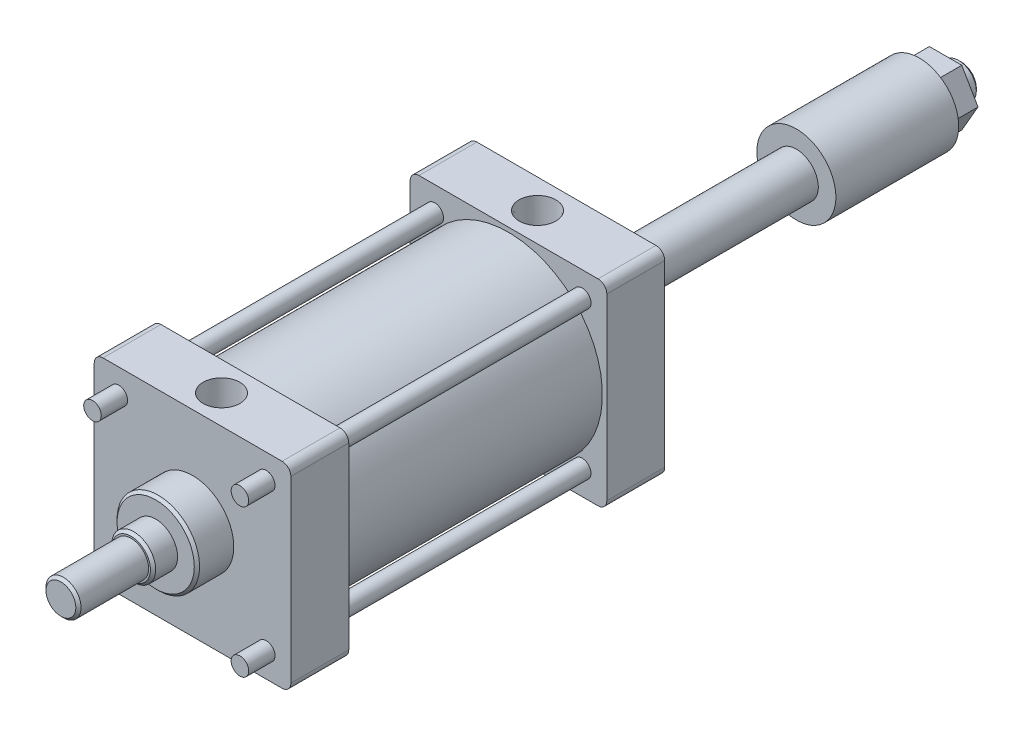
from build123d import *

# Parameters (mm, degrees)
SKETCH_1_R              = 5
EXTRUDE_1_DEPTH         = 33
SKETCH_2_R              = 23.5
EXTRUDE_2_DEPTH         = 21
SKETCH_3_R              = 12.5
EXTRUDE_3_DEPTH         = 14
SKETCH_4_R              = 10
EXTRUDE_4_DEPTH         = 40
CHAMFER_1_SIZE          = 1.5
SKETCH_5_R              = 53.5
EXTRUDE_5_DEPTH         = 147
EXTRUDE_START           = 33
SKETCH_7_R              = 5
EXTRUDE_6_DEPTH         = 33
EXTRUDE_START_2         = 21
SKETCH_8_R              = 23.5
EXTRUDE_7_DEPTH         = 21
CHAMFER_2_SIZE          = 1.5
SKETCH_9_R              = 22.5
EXTRUDE_8_DEPTH         = 10
EXTRUDE_START_3         = 100
SKETCH_10_R             = 12.5
EXTRUDE_9_DEPTH         = 100
SKETCH_11_R             = 22.5
EXTRUDE_10_DEPTH        = 70
EXTRUDE_11_DEPTH        = 15
EXTRUDE_START_4         = 9
SKETCH_13_R             = 10
EXTRUDE_12_DEPTH        = 9
CHAMFER_3_SIZE          = 1.5
EXTRUDE_13_DEPTH        = 15
EXTRUDE_13_DEPTH_BACK   = 213
SKETCH_14_R             = 5
EXTRUDE_13_2_DEPTH      = 15
EXTRUDE_13_2_DEPTH_BACK = 213
EXTRUDE_13_3_DEPTH      = 15
EXTRUDE_13_3_DEPTH_BACK = 213
EXTRUDE_13_4_DEPTH      = 15
EXTRUDE_13_4_DEPTH_BACK = 213
F_1_2_RC_1_AT_2_COUNT   = 2
F_1_2_RC_1_AT_2_PITCH   = 180


with BuildPart() as part:
    # Sketch 1 → Extrude 1 (new body)
    with BuildSketch(Plane.XY):
        with BuildLine():
            Line((51, 56), (-51, 56))
            ThreePointArc((-51, 56), (-54.535533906, 54.535533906), (-56, 51))
            Line((-56, 51), (-56, -51))
            ThreePointArc((-56, -51), (-54.535533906, -54.535533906), (-51, -56))
            Line((-51, -56), (51, -56))
            ThreePointArc((51, -56), (54.535533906, -54.535533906), (56, -51))
            Line((56, -51), (56, 51))
            ThreePointArc((56, 51), (54.535533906, 54.535533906), (51, 56))
        make_face()
        with Locations((42, -42)):
            Circle(SKETCH_1_R, mode=Mode.SUBTRACT)
        with Locations((-42, -42)):
            Circle(SKETCH_1_R, mode=Mode.SUBTRACT)
        with Locations((-42, 42)):
            Circle(SKETCH_1_R, mode=Mode.SUBTRACT)
        with Locations((42, 42)):
            Circle(SKETCH_1_R, mode=Mode.SUBTRACT)
    extrude(amount=EXTRUDE_1_DEPTH)

    # Sketch 2 → Extrude 2 (add)
    with BuildSketch(Plane.XY.offset(33)):
        with Locations(Location((0, 0, 0), (0, 0, 180))):
            Circle(SKETCH_2_R)
    extrude(amount=EXTRUDE_2_DEPTH)

    # Sketch 3 → Extrude 3 (add)
    with BuildSketch(Plane.XY.offset(54)):
        Circle(SKETCH_3_R)
    extrude(amount=EXTRUDE_3_DEPTH)

    # Sketch 4 → Extrude 4 (add)
    with BuildSketch(Plane.XY.offset(68)):
        Circle(SKETCH_4_R)
    extrude(amount=EXTRUDE_4_DEPTH)

    # Chamfer 1
    chamfer_1_edges = [part.edges().sort_by_distance(p)[0] for p in [
        (23.5, 0, 54),
        (-12.5, 0, 68),
        (-10, 0, 108),
    ]]
    chamfer(chamfer_1_edges, length=CHAMFER_1_SIZE)

    # Sketch 5 → Extrude 5 (add)
    with BuildSketch(Plane(origin=(0, 0, 0), x_dir=(-1, 0, 0), z_dir=(0, 0, -1))):
        Circle(SKETCH_5_R)
    extrude(amount=EXTRUDE_5_DEPTH)

    # Sketch 7 → Extrude 6 (add)
    with BuildSketch(Plane(origin=(0, 0, -147), x_dir=(-1, 0, 0), z_dir=(0, 0, -1)).offset(EXTRUDE_START)):
        with BuildLine():
            Line((-56, 51), (-56, -51))
            ThreePointArc((-56, -51), (-54.535533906, -54.535533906), (-51, -56))
            Line((-51, -56), (51, -56))
            ThreePointArc((51, -56), (54.535533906, -54.535533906), (56, -51))
            Line((56, -51), (56, 51))
            ThreePointArc((56, 51), (54.535533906, 54.535533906), (51, 56))
            Line((51, 56), (-51, 56))
            ThreePointArc((-51, 56), (-54.535533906, 54.535533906), (-56, 51))
        make_face()
        with Locations(Location((42, -42, 0), (0, 0, 180))):
            Circle(SKETCH_7_R, mode=Mode.SUBTRACT)
        with Locations(Location((-42, -42, 0), (0, 0, 180))):
            Circle(SKETCH_7_R, mode=Mode.SUBTRACT)
        with Locations(Location((42, 42, 0), (0, 0, 180))):
            Circle(SKETCH_7_R, mode=Mode.SUBTRACT)
        with Locations(Location((-42, 42, 0), (0, 0, 180))):
            Circle(SKETCH_7_R, mode=Mode.SUBTRACT)
    extrude(amount=-EXTRUDE_6_DEPTH)

    # Sketch 8 → Extrude 7 (add)
    with BuildSketch(Plane(origin=(0, 0, -180), x_dir=(-1, 0, 0), z_dir=(0, 0, -1)).offset(EXTRUDE_START_2)):
        Circle(SKETCH_8_R)
    extrude(amount=-EXTRUDE_7_DEPTH)

    # Chamfer 2
    chamfer_2_edges = [part.edges().sort_by_distance(p)[0] for p in [
        (23.5, 0, -201),
    ]]
    chamfer(chamfer_2_edges, length=CHAMFER_2_SIZE)

    # Sketch 9 → Extrude 8 (add)
    with BuildSketch(Plane(origin=(0, 0, -201), x_dir=(-1, 0, 0), z_dir=(0, 0, -1))):
        Circle(SKETCH_9_R)
    extrude(amount=EXTRUDE_8_DEPTH)

    # Sketch 10 → Extrude 9 (add)
    with BuildSketch(Plane(origin=(0, 0, -211), x_dir=(-1, 0, 0), z_dir=(0, 0, -1)).offset(EXTRUDE_START_3)):
        with Locations(Location((0, 0, 0), (0, 0, 180))):
            Circle(SKETCH_10_R)
    extrude(amount=-EXTRUDE_9_DEPTH)

    # Sketch 11 → Extrude 10 (add)
    with BuildSketch(Plane(origin=(0, 0, -311), x_dir=(-1, 0, 0), z_dir=(0, 0, -1))):
        Circle(SKETCH_11_R)
    extrude(amount=EXTRUDE_10_DEPTH)

    # Sketch 12 → Extrude 11 (add)
    with BuildSketch(Plane(origin=(0, 0, -381), x_dir=(-1, 0, 0), z_dir=(0, 0, -1))):
        Polygon((18.475208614, 0), (9.237604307, 16), (-9.237604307, 16), (-18.475208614, 0), (-9.237604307, -16), (9.237604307, -16), align=None)
    extrude(amount=EXTRUDE_11_DEPTH)

    # Sketch 13 → Extrude 12 (add)
    with BuildSketch(Plane(origin=(0, 0, -396), x_dir=(-1, 0, 0), z_dir=(0, 0, -1)).offset(EXTRUDE_START_4)):
        with Locations(Location((0, 0, 0), (0, 0, 180))):
            Circle(SKETCH_13_R)
    extrude(amount=-EXTRUDE_12_DEPTH)

    # Chamfer 3
    chamfer_3_edges = [part.edges().sort_by_distance(p)[0] for p in [
        (-10, 0, -405),
    ]]
    chamfer(chamfer_3_edges, length=CHAMFER_3_SIZE)

    # Sketch 16 → 1_2 Rc _1 (revolve, cut)
    with BuildSketch(Plane(origin=(0, 56, 16.5), x_dir=(0, 0, 1), z_dir=(1, 0, 0))):
        Polygon((0, 0), (0, 29.327530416), (8.75, 24.07), (8.75, 15), (10.009250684, 15), (10.4775, 0), align=None)
    f_1_2_rc_1 = revolve(axis=Axis((0, 62.35, 16.5), (0, -1, 0)), mode=Mode.SUBTRACT)

    # 1_2 Rc _1 at 2: 1_2 Rc _1 ×2
    with Locations(*[(0, 0, -i * F_1_2_RC_1_AT_2_PITCH) for i in range(1, F_1_2_RC_1_AT_2_COUNT)]):
        add(f_1_2_rc_1, mode=Mode.SUBTRACT)


with BuildPart() as body_2:
    # Sketch 14 → Extrude 13 (new, two sides: drawn at the far end of the back side and taken through both)
    with BuildSketch(Plane.XY.offset(33).offset(-EXTRUDE_13_DEPTH_BACK)):
        with Locations((-42, 42)):
            Circle(SKETCH_14_R)
    extrude(amount=EXTRUDE_13_DEPTH + EXTRUDE_13_DEPTH_BACK)


with BuildPart() as body_3:
    # Sketch 14 → Extrude 13 2 (new, two sides: drawn at the far end of the back side and taken through both)
    with BuildSketch(Plane.XY.offset(33).offset(-EXTRUDE_13_2_DEPTH_BACK)):
        with Locations((42, 42)):
            Circle(SKETCH_14_R)
    extrude(amount=EXTRUDE_13_2_DEPTH + EXTRUDE_13_2_DEPTH_BACK)


with BuildPart() as body_4:
    # Sketch 14 → Extrude 13 3 (new, two sides: drawn at the far end of the back side and taken through both)
    with BuildSketch(Plane.XY.offset(33).offset(-EXTRUDE_13_3_DEPTH_BACK)):
        with Locations((42, -42)):
            Circle(SKETCH_14_R)
    extrude(amount=EXTRUDE_13_3_DEPTH + EXTRUDE_13_3_DEPTH_BACK)


with BuildPart() as body_5:
    # Sketch 14 → Extrude 13 4 (new, two sides: drawn at the far end of the back side and taken through both)
    with BuildSketch(Plane.XY.offset(33).offset(-EXTRUDE_13_4_DEPTH_BACK)):
        with Locations((-42, -42)):
            Circle(SKETCH_14_R)
    extrude(amount=EXTRUDE_13_4_DEPTH + EXTRUDE_13_4_DEPTH_BACK)


solid = Compound([part.part, body_2.part, body_3.part, body_4.part, body_5.part])
